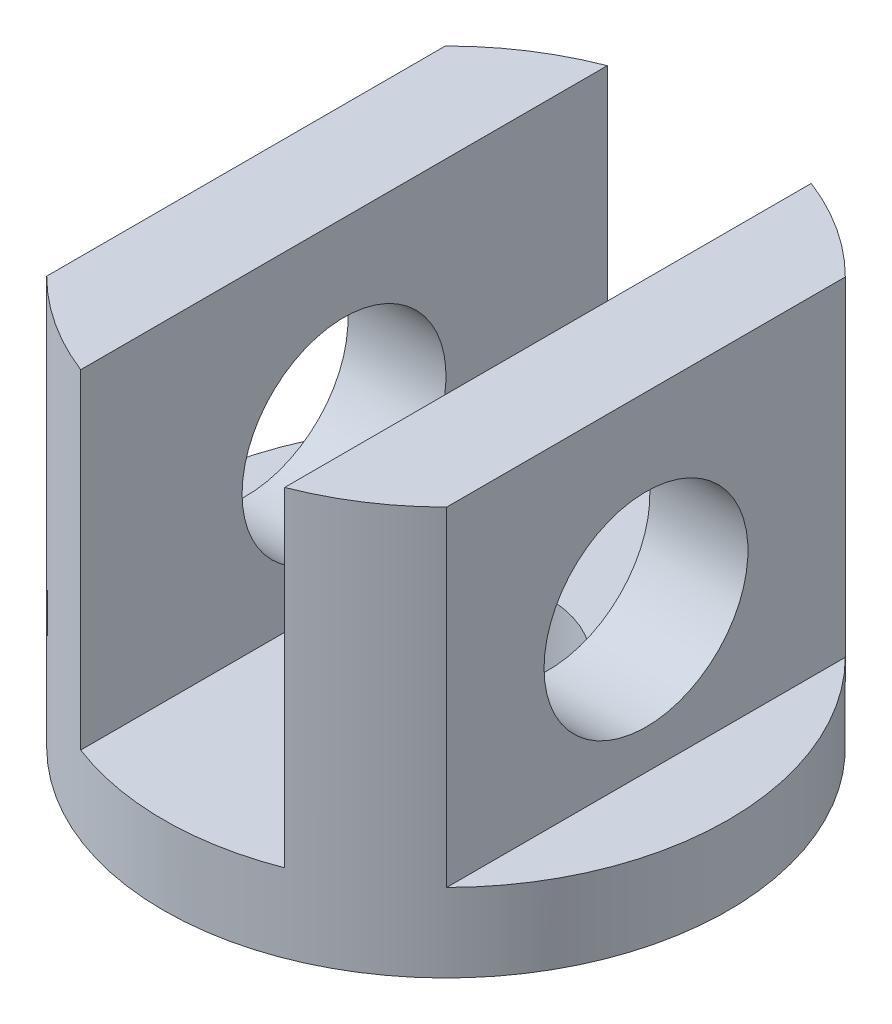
ISO-10303-21;
HEADER;
FILE_DESCRIPTION(('STEP AP214'),'2;1');
FILE_NAME('part.step','',(''),(''),'','','');
FILE_SCHEMA(('AUTOMOTIVE_DESIGN { 1 0 10303 214 1 1 1 1 }'));
ENDSEC;
DATA;
#1=APPLICATION_CONTEXT('core data for automotive mechanical design processes');
#2=APPLICATION_PROTOCOL_DEFINITION('international standard','automotive_design',2000,#1);
#3=PRODUCT_CONTEXT('',#1,'mechanical');
#4=PRODUCT('Part','Part','',(#3));
#5=PRODUCT_RELATED_PRODUCT_CATEGORY('part','',(#4));
#6=PRODUCT_DEFINITION_FORMATION('','',#4);
#7=PRODUCT_DEFINITION_CONTEXT('part definition',#1,'design');
#8=PRODUCT_DEFINITION('design','',#6,#7);
#9=PRODUCT_DEFINITION_SHAPE('','',#8);
#10=(LENGTH_UNIT() NAMED_UNIT(*) SI_UNIT(.MILLI.,.METRE.));
#11=(NAMED_UNIT(*) PLANE_ANGLE_UNIT() SI_UNIT($,.RADIAN.));
#12=(NAMED_UNIT(*) SI_UNIT($,.STERADIAN.) SOLID_ANGLE_UNIT());
#13=UNCERTAINTY_MEASURE_WITH_UNIT(LENGTH_MEASURE(1.E-05),#10,'distance_accuracy_value','');
#14=(GEOMETRIC_REPRESENTATION_CONTEXT(3) GLOBAL_UNCERTAINTY_ASSIGNED_CONTEXT((#13)) GLOBAL_UNIT_ASSIGNED_CONTEXT((#10,
#11,#12)) REPRESENTATION_CONTEXT('',''));
#15=CARTESIAN_POINT('',(0.,0.,0.));
#16=DIRECTION('',(0.,0.,1.));
#17=DIRECTION('',(1.,0.,0.));
#18=AXIS2_PLACEMENT_3D('',#15,#16,#17);
#19=CARTESIAN_POINT('',(-26.,20.,-75.));
#20=DIRECTION('',(0.,-1.,0.));
#21=DIRECTION('',(0.,0.,-1.));
#22=AXIS2_PLACEMENT_3D('',#19,#20,#21);
#23=PLANE('',#22);
#24=DIRECTION('',(0.,0.,1.));
#25=VECTOR('',#24,1.);
#26=CARTESIAN_POINT('',(26.,20.,-75.));
#27=LINE('',#26,#25);
#28=CARTESIAN_POINT('',(26.,20.,0.));
#29=VERTEX_POINT('',#28);
#30=CARTESIAN_POINT('',(26.,20.,67.1416413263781));
#31=VERTEX_POINT('',#30);
#32=EDGE_CURVE('E201',#29,#31,#27,.T.);
#33=ORIENTED_EDGE('',*,*,#32,.F.);
#34=CARTESIAN_POINT('',(0.,20.,0.));
#35=DIRECTION('',(0.,1.,0.));
#36=DIRECTION('',(0.,0.,1.));
#37=AXIS2_PLACEMENT_3D('',#34,#35,#36);
#38=CIRCLE('',#37,26.);
#39=CARTESIAN_POINT('',(-26.,20.,0.));
#40=VERTEX_POINT('',#39);
#41=EDGE_CURVE('E110',#40,#29,#38,.T.);
#42=ORIENTED_EDGE('',*,*,#41,.F.);
#43=DIRECTION('',(0.,0.,1.));
#44=VECTOR('',#43,1.);
#45=CARTESIAN_POINT('',(-26.,20.,-75.));
#46=LINE('',#45,#44);
#47=CARTESIAN_POINT('',(-26.,20.,67.1416413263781));
#48=VERTEX_POINT('',#47);
#49=EDGE_CURVE('E202',#40,#48,#46,.T.);
#50=ORIENTED_EDGE('',*,*,#49,.T.);
#51=CARTESIAN_POINT('',(0.,20.,0.));
#52=DIRECTION('',(0.,1.,0.));
#53=DIRECTION('',(0.,0.,1.));
#54=AXIS2_PLACEMENT_3D('',#51,#52,#53);
#55=CIRCLE('',#54,72.);
#56=EDGE_CURVE('E145',#48,#31,#55,.T.);
#57=ORIENTED_EDGE('',*,*,#56,.T.);
#58=EDGE_LOOP('',(#33,#42,#50,#57));
#59=FACE_BOUND('',#58,.T.);
#60=ADVANCED_FACE('F35',(#59),#23,.F.);
#61=CARTESIAN_POINT('',(-51.,104.,75.));
#62=DIRECTION('',(0.,1.,0.));
#63=DIRECTION('',(0.,0.,1.));
#64=AXIS2_PLACEMENT_3D('',#61,#62,#63);
#65=PLANE('',#64);
#66=CARTESIAN_POINT('',(0.,104.,0.));
#67=DIRECTION('',(0.,1.,0.));
#68=DIRECTION('',(0.,0.,1.));
#69=AXIS2_PLACEMENT_3D('',#66,#67,#68);
#70=CIRCLE('',#69,72.);
#71=CARTESIAN_POINT('',(-51.,104.,50.8232230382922));
#72=VERTEX_POINT('',#71);
#73=CARTESIAN_POINT('',(-26.,104.,67.1416413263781));
#74=VERTEX_POINT('',#73);
#75=EDGE_CURVE('E124',#72,#74,#70,.T.);
#76=ORIENTED_EDGE('',*,*,#75,.T.);
#77=DIRECTION('',(0.,0.,1.));
#78=VECTOR('',#77,1.);
#79=CARTESIAN_POINT('',(-26.,104.,-75.));
#80=LINE('',#79,#78);
#81=CARTESIAN_POINT('',(-26.,104.,-67.1416413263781));
#82=VERTEX_POINT('',#81);
#83=EDGE_CURVE('E135',#82,#74,#80,.T.);
#84=ORIENTED_EDGE('',*,*,#83,.F.);
#85=CARTESIAN_POINT('',(-51.,104.,-50.8232230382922));
#86=VERTEX_POINT('',#85);
#87=EDGE_CURVE('E50',#82,#86,#70,.T.);
#88=ORIENTED_EDGE('',*,*,#87,.T.);
#89=DIRECTION('',(0.,0.,1.));
#90=VECTOR('',#89,1.);
#91=CARTESIAN_POINT('',(-51.,104.,75.));
#92=LINE('',#91,#90);
#93=EDGE_CURVE('E128',#86,#72,#92,.T.);
#94=ORIENTED_EDGE('',*,*,#93,.T.);
#95=EDGE_LOOP('',(#76,#84,#88,#94));
#96=FACE_BOUND('',#95,.T.);
#97=ADVANCED_FACE('F168',(#96),#65,.T.);
#98=CARTESIAN_POINT('',(0.,20.,0.));
#99=DIRECTION('',(0.,1.,0.));
#100=DIRECTION('',(0.,0.,1.));
#101=AXIS2_PLACEMENT_3D('',#98,#99,#100);
#102=PLANE('',#101);
#103=CARTESIAN_POINT('',(-51.,20.,-50.8232230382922));
#104=VERTEX_POINT('',#103);
#105=CARTESIAN_POINT('',(-51.,20.,50.8232230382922));
#106=VERTEX_POINT('',#105);
#107=EDGE_CURVE('E144',#104,#106,#55,.T.);
#108=ORIENTED_EDGE('',*,*,#107,.T.);
#109=DIRECTION('',(0.,0.,-1.));
#110=VECTOR('',#109,1.);
#111=CARTESIAN_POINT('',(-51.,20.,75.));
#112=LINE('',#111,#110);
#113=EDGE_CURVE('E140',#106,#104,#112,.T.);
#114=ORIENTED_EDGE('',*,*,#113,.T.);
#115=EDGE_LOOP('',(#108,#114));
#116=FACE_BOUND('',#115,.T.);
#117=ADVANCED_FACE('F160',(#116),#102,.T.);
#118=CARTESIAN_POINT('',(0.,20.,0.));
#119=DIRECTION('',(0.,-1.,0.));
#120=DIRECTION('',(0.,0.,-1.));
#121=AXIS2_PLACEMENT_3D('',#118,#119,#120);
#122=CYLINDRICAL_SURFACE('',#121,72.);
#123=CARTESIAN_POINT('',(51.,20.,50.8232230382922));
#124=VERTEX_POINT('',#123);
#125=CARTESIAN_POINT('',(51.,20.,-50.8232230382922));
#126=VERTEX_POINT('',#125);
#127=EDGE_CURVE('E105',#124,#126,#55,.T.);
#128=ORIENTED_EDGE('',*,*,#127,.F.);
#129=DIRECTION('',(0.,-1.,0.));
#130=VECTOR('',#129,1.);
#131=CARTESIAN_POINT('',(51.,104.,50.8232230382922));
#132=LINE('',#131,#130);
#133=CARTESIAN_POINT('',(51.,104.,50.8232230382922));
#134=VERTEX_POINT('',#133);
#135=EDGE_CURVE('E102',#134,#124,#132,.T.);
#136=ORIENTED_EDGE('',*,*,#135,.F.);
#137=CARTESIAN_POINT('',(26.,104.,67.1416413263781));
#138=VERTEX_POINT('',#137);
#139=EDGE_CURVE('E57',#138,#134,#70,.T.);
#140=ORIENTED_EDGE('',*,*,#139,.F.);
#141=DIRECTION('',(0.,-1.,0.));
#142=VECTOR('',#141,1.);
#143=CARTESIAN_POINT('',(26.,104.,67.1416413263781));
#144=LINE('',#143,#142);
#145=EDGE_CURVE('E13',#31,#138,#144,.F.);
#146=ORIENTED_EDGE('',*,*,#145,.F.);
#147=ORIENTED_EDGE('',*,*,#56,.F.);
#148=DIRECTION('',(0.,-1.,0.));
#149=VECTOR('',#148,1.);
#150=CARTESIAN_POINT('',(-26.,104.,67.1416413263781));
#151=LINE('',#150,#149);
#152=EDGE_CURVE('E226',#74,#48,#151,.T.);
#153=ORIENTED_EDGE('',*,*,#152,.F.);
#154=ORIENTED_EDGE('',*,*,#75,.F.);
#155=DIRECTION('',(0.,-1.,0.));
#156=VECTOR('',#155,1.);
#157=CARTESIAN_POINT('',(-51.,104.,50.8232230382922));
#158=LINE('',#157,#156);
#159=EDGE_CURVE('E224',#72,#106,#158,.T.);
#160=ORIENTED_EDGE('',*,*,#159,.T.);
#161=ORIENTED_EDGE('',*,*,#107,.F.);
#162=DIRECTION('',(0.,-1.,0.));
#163=VECTOR('',#162,1.);
#164=CARTESIAN_POINT('',(-51.,104.,-50.8232230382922));
#165=LINE('',#164,#163);
#166=EDGE_CURVE('E121',#104,#86,#165,.F.);
#167=ORIENTED_EDGE('',*,*,#166,.T.);
#168=ORIENTED_EDGE('',*,*,#87,.F.);
#169=DIRECTION('',(0.,-1.,0.));
#170=VECTOR('',#169,1.);
#171=CARTESIAN_POINT('',(-26.,104.,-67.1416413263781));
#172=LINE('',#171,#170);
#173=CARTESIAN_POINT('',(-26.,20.,-67.1416413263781));
#174=VERTEX_POINT('',#173);
#175=EDGE_CURVE('E111',#174,#82,#172,.F.);
#176=ORIENTED_EDGE('',*,*,#175,.F.);
#177=CARTESIAN_POINT('',(0.,20.,0.));
#178=DIRECTION('',(0.,-1.,0.));
#179=DIRECTION('',(0.,0.,-1.));
#180=AXIS2_PLACEMENT_3D('',#177,#178,#179);
#181=CIRCLE('',#180,72.);
#182=CARTESIAN_POINT('',(26.,20.,-67.1416413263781));
#183=VERTEX_POINT('',#182);
#184=EDGE_CURVE('E129',#174,#183,#181,.T.);
#185=ORIENTED_EDGE('',*,*,#184,.T.);
#186=DIRECTION('',(0.,-1.,0.));
#187=VECTOR('',#186,1.);
#188=CARTESIAN_POINT('',(26.,104.,-67.1416413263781));
#189=LINE('',#188,#187);
#190=CARTESIAN_POINT('',(26.,104.,-67.1416413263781));
#191=VERTEX_POINT('',#190);
#192=EDGE_CURVE('E43',#191,#183,#189,.T.);
#193=ORIENTED_EDGE('',*,*,#192,.F.);
#194=CARTESIAN_POINT('',(51.,104.,-50.8232230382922));
#195=VERTEX_POINT('',#194);
#196=EDGE_CURVE('E122',#195,#191,#70,.T.);
#197=ORIENTED_EDGE('',*,*,#196,.F.);
#198=DIRECTION('',(0.,-1.,0.));
#199=VECTOR('',#198,1.);
#200=CARTESIAN_POINT('',(51.,104.,-50.8232230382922));
#201=LINE('',#200,#199);
#202=EDGE_CURVE('E127',#126,#195,#201,.F.);
#203=ORIENTED_EDGE('',*,*,#202,.F.);
#204=EDGE_LOOP('',(#128,#136,#140,#146,#147,#153,#154,#160,#161,#167,#168,#176,#185,#193,#197,#203));
#205=FACE_BOUND('',#204,.T.);
#206=CARTESIAN_POINT('',(0.,0.,0.));
#207=DIRECTION('',(0.,1.,0.));
#208=DIRECTION('',(0.,0.,1.));
#209=AXIS2_PLACEMENT_3D('',#206,#207,#208);
#210=CIRCLE('',#209,72.);
#211=CARTESIAN_POINT('',(0.,0.,72.));
#212=VERTEX_POINT('',#211);
#213=EDGE_CURVE('E132',#212,#212,#210,.T.);
#214=ORIENTED_EDGE('',*,*,#213,.T.);
#215=EDGE_LOOP('',(#214));
#216=FACE_BOUND('',#215,.T.);
#217=ADVANCED_FACE('F37',(#205,#216),#122,.T.);
#218=DIRECTION('',(0.,0.,-1.));
#219=VECTOR('',#218,1.);
#220=CARTESIAN_POINT('',(51.,20.,75.));
#221=LINE('',#220,#219);
#222=EDGE_CURVE('E139',#124,#126,#221,.T.);
#223=ORIENTED_EDGE('',*,*,#222,.F.);
#224=ORIENTED_EDGE('',*,*,#127,.T.);
#225=EDGE_LOOP('',(#223,#224));
#226=FACE_BOUND('',#225,.T.);
#227=ADVANCED_FACE('F156',(#226),#102,.T.);
#228=CARTESIAN_POINT('',(0.,0.,0.));
#229=DIRECTION('',(0.,1.,0.));
#230=DIRECTION('',(0.,0.,1.));
#231=AXIS2_PLACEMENT_3D('',#228,#229,#230);
#232=PLANE('',#231);
#233=CARTESIAN_POINT('',(0.,0.,0.));
#234=DIRECTION('',(0.,1.,0.));
#235=DIRECTION('',(0.,0.,1.));
#236=AXIS2_PLACEMENT_3D('',#233,#234,#235);
#237=CIRCLE('',#236,26.);
#238=CARTESIAN_POINT('',(0.,0.,26.));
#239=VERTEX_POINT('',#238);
#240=EDGE_CURVE('E219',#239,#239,#237,.T.);
#241=ORIENTED_EDGE('',*,*,#240,.T.);
#242=EDGE_LOOP('',(#241));
#243=FACE_BOUND('',#242,.T.);
#244=ORIENTED_EDGE('',*,*,#213,.F.);
#245=EDGE_LOOP('',(#244));
#246=FACE_BOUND('',#245,.T.);
#247=ADVANCED_FACE('F158',(#243,#246),#232,.F.);
#248=ORIENTED_EDGE('',*,*,#196,.T.);
#249=DIRECTION('',(0.,0.,1.));
#250=VECTOR('',#249,1.);
#251=CARTESIAN_POINT('',(26.,104.,-75.));
#252=LINE('',#251,#250);
#253=EDGE_CURVE('E120',#191,#138,#252,.T.);
#254=ORIENTED_EDGE('',*,*,#253,.T.);
#255=ORIENTED_EDGE('',*,*,#139,.T.);
#256=DIRECTION('',(0.,0.,1.));
#257=VECTOR('',#256,1.);
#258=CARTESIAN_POINT('',(51.,104.,75.));
#259=LINE('',#258,#257);
#260=EDGE_CURVE('E118',#195,#134,#259,.T.);
#261=ORIENTED_EDGE('',*,*,#260,.F.);
#262=EDGE_LOOP('',(#248,#254,#255,#261));
#263=FACE_BOUND('',#262,.T.);
#264=ADVANCED_FACE('F117',(#263),#65,.T.);
#265=CARTESIAN_POINT('',(-51.,20.,75.));
#266=DIRECTION('',(-1.,0.,0.));
#267=DIRECTION('',(0.,0.,1.));
#268=AXIS2_PLACEMENT_3D('',#265,#266,#267);
#269=PLANE('',#268);
#270=ORIENTED_EDGE('',*,*,#166,.F.);
#271=ORIENTED_EDGE('',*,*,#113,.F.);
#272=ORIENTED_EDGE('',*,*,#159,.F.);
#273=ORIENTED_EDGE('',*,*,#93,.F.);
#274=EDGE_LOOP('',(#270,#271,#272,#273));
#275=FACE_BOUND('',#274,.T.);
#276=CARTESIAN_POINT('',(-51.,56.,0.));
#277=DIRECTION('',(-1.,0.,0.));
#278=DIRECTION('',(0.,0.,1.));
#279=AXIS2_PLACEMENT_3D('',#276,#277,#278);
#280=CIRCLE('',#279,26.);
#281=CARTESIAN_POINT('',(-51.,56.,26.));
#282=VERTEX_POINT('',#281);
#283=EDGE_CURVE('E151',#282,#282,#280,.T.);
#284=ORIENTED_EDGE('',*,*,#283,.F.);
#285=EDGE_LOOP('',(#284));
#286=FACE_BOUND('',#285,.T.);
#287=ADVANCED_FACE('F190',(#275,#286),#269,.T.);
#288=CARTESIAN_POINT('',(51.,20.,75.));
#289=DIRECTION('',(-1.,0.,0.));
#290=DIRECTION('',(0.,0.,1.));
#291=AXIS2_PLACEMENT_3D('',#288,#289,#290);
#292=PLANE('',#291);
#293=CARTESIAN_POINT('',(51.,56.,0.));
#294=DIRECTION('',(-1.,0.,0.));
#295=DIRECTION('',(0.,0.,1.));
#296=AXIS2_PLACEMENT_3D('',#293,#294,#295);
#297=CIRCLE('',#296,26.);
#298=CARTESIAN_POINT('',(51.,56.,26.));
#299=VERTEX_POINT('',#298);
#300=EDGE_CURVE('E208',#299,#299,#297,.T.);
#301=ORIENTED_EDGE('',*,*,#300,.T.);
#302=EDGE_LOOP('',(#301));
#303=FACE_BOUND('',#302,.T.);
#304=ORIENTED_EDGE('',*,*,#222,.T.);
#305=ORIENTED_EDGE('',*,*,#202,.T.);
#306=ORIENTED_EDGE('',*,*,#260,.T.);
#307=ORIENTED_EDGE('',*,*,#135,.T.);
#308=EDGE_LOOP('',(#304,#305,#306,#307));
#309=FACE_BOUND('',#308,.T.);
#310=ADVANCED_FACE('F126',(#303,#309),#292,.F.);
#311=EDGE_CURVE('E197',#174,#40,#46,.T.);
#312=ORIENTED_EDGE('',*,*,#311,.T.);
#313=EDGE_CURVE('E198',#29,#40,#38,.T.);
#314=ORIENTED_EDGE('',*,*,#313,.F.);
#315=EDGE_CURVE('E205',#183,#29,#27,.T.);
#316=ORIENTED_EDGE('',*,*,#315,.F.);
#317=ORIENTED_EDGE('',*,*,#184,.F.);
#318=EDGE_LOOP('',(#312,#314,#316,#317));
#319=FACE_BOUND('',#318,.T.);
#320=ADVANCED_FACE('F173',(#319),#23,.F.);
#321=CARTESIAN_POINT('',(-26.,104.,-75.));
#322=DIRECTION('',(-1.,0.,0.));
#323=DIRECTION('',(0.,-1.,0.));
#324=AXIS2_PLACEMENT_3D('',#321,#322,#323);
#325=PLANE('',#324);
#326=CARTESIAN_POINT('',(-26.,56.,0.));
#327=DIRECTION('',(-1.,0.,0.));
#328=DIRECTION('',(0.,-1.,0.));
#329=AXIS2_PLACEMENT_3D('',#326,#327,#328);
#330=CIRCLE('',#329,26.);
#331=CARTESIAN_POINT('',(-26.,30.,0.));
#332=VERTEX_POINT('',#331);
#333=EDGE_CURVE('E150',#332,#332,#330,.T.);
#334=ORIENTED_EDGE('',*,*,#333,.T.);
#335=EDGE_LOOP('',(#334));
#336=FACE_BOUND('',#335,.T.);
#337=ORIENTED_EDGE('',*,*,#311,.F.);
#338=ORIENTED_EDGE('',*,*,#175,.T.);
#339=ORIENTED_EDGE('',*,*,#83,.T.);
#340=ORIENTED_EDGE('',*,*,#152,.T.);
#341=ORIENTED_EDGE('',*,*,#49,.F.);
#342=EDGE_LOOP('',(#337,#338,#339,#340,#341));
#343=FACE_BOUND('',#342,.T.);
#344=ADVANCED_FACE('F182',(#336,#343),#325,.F.);
#345=CARTESIAN_POINT('',(26.,104.,-75.));
#346=DIRECTION('',(1.,0.,0.));
#347=DIRECTION('',(0.,1.,0.));
#348=AXIS2_PLACEMENT_3D('',#345,#346,#347);
#349=PLANE('',#348);
#350=CARTESIAN_POINT('',(26.,56.,0.));
#351=DIRECTION('',(1.,0.,0.));
#352=DIRECTION('',(0.,1.,0.));
#353=AXIS2_PLACEMENT_3D('',#350,#351,#352);
#354=CIRCLE('',#353,26.);
#355=CARTESIAN_POINT('',(26.,82.,0.));
#356=VERTEX_POINT('',#355);
#357=EDGE_CURVE('E148',#356,#356,#354,.T.);
#358=ORIENTED_EDGE('',*,*,#357,.T.);
#359=EDGE_LOOP('',(#358));
#360=FACE_BOUND('',#359,.T.);
#361=ORIENTED_EDGE('',*,*,#32,.T.);
#362=ORIENTED_EDGE('',*,*,#145,.T.);
#363=ORIENTED_EDGE('',*,*,#253,.F.);
#364=ORIENTED_EDGE('',*,*,#192,.T.);
#365=ORIENTED_EDGE('',*,*,#315,.T.);
#366=EDGE_LOOP('',(#361,#362,#363,#364,#365));
#367=FACE_BOUND('',#366,.T.);
#368=ADVANCED_FACE('F188',(#360,#367),#349,.F.);
#369=CARTESIAN_POINT('',(72.,56.,0.));
#370=DIRECTION('',(-1.,0.,0.));
#371=DIRECTION('',(0.,0.,1.));
#372=AXIS2_PLACEMENT_3D('',#369,#370,#371);
#373=CYLINDRICAL_SURFACE('',#372,26.);
#374=ORIENTED_EDGE('',*,*,#357,.F.);
#375=EDGE_LOOP('',(#374));
#376=FACE_BOUND('',#375,.T.);
#377=ORIENTED_EDGE('',*,*,#300,.F.);
#378=EDGE_LOOP('',(#377));
#379=FACE_BOUND('',#378,.T.);
#380=ADVANCED_FACE('F250',(#376,#379),#373,.F.);
#381=ORIENTED_EDGE('',*,*,#283,.T.);
#382=EDGE_LOOP('',(#381));
#383=FACE_BOUND('',#382,.T.);
#384=ORIENTED_EDGE('',*,*,#333,.F.);
#385=EDGE_LOOP('',(#384));
#386=FACE_BOUND('',#385,.T.);
#387=ADVANCED_FACE('F244',(#383,#386),#373,.F.);
#388=CARTESIAN_POINT('',(0.,0.,0.));
#389=DIRECTION('',(0.,1.,0.));
#390=DIRECTION('',(0.,0.,1.));
#391=AXIS2_PLACEMENT_3D('',#388,#389,#390);
#392=CYLINDRICAL_SURFACE('',#391,26.);
#393=ORIENTED_EDGE('',*,*,#240,.F.);
#394=EDGE_LOOP('',(#393));
#395=FACE_BOUND('',#394,.T.);
#396=ORIENTED_EDGE('',*,*,#313,.T.);
#397=ORIENTED_EDGE('',*,*,#41,.T.);
#398=EDGE_LOOP('',(#396,#397));
#399=FACE_BOUND('',#398,.T.);
#400=ADVANCED_FACE('F242',(#395,#399),#392,.F.);
#401=CLOSED_SHELL('',(#60,#97,#117,#217,#227,#247,#264,#287,#310,#320,#344,#368,#380,#387,#400));
#402=MANIFOLD_SOLID_BREP('B2',#401);
#403=ADVANCED_BREP_SHAPE_REPRESENTATION('',(#18,#402),#14);
#404=SHAPE_DEFINITION_REPRESENTATION(#9,#403);
ENDSEC;
END-ISO-10303-21;
